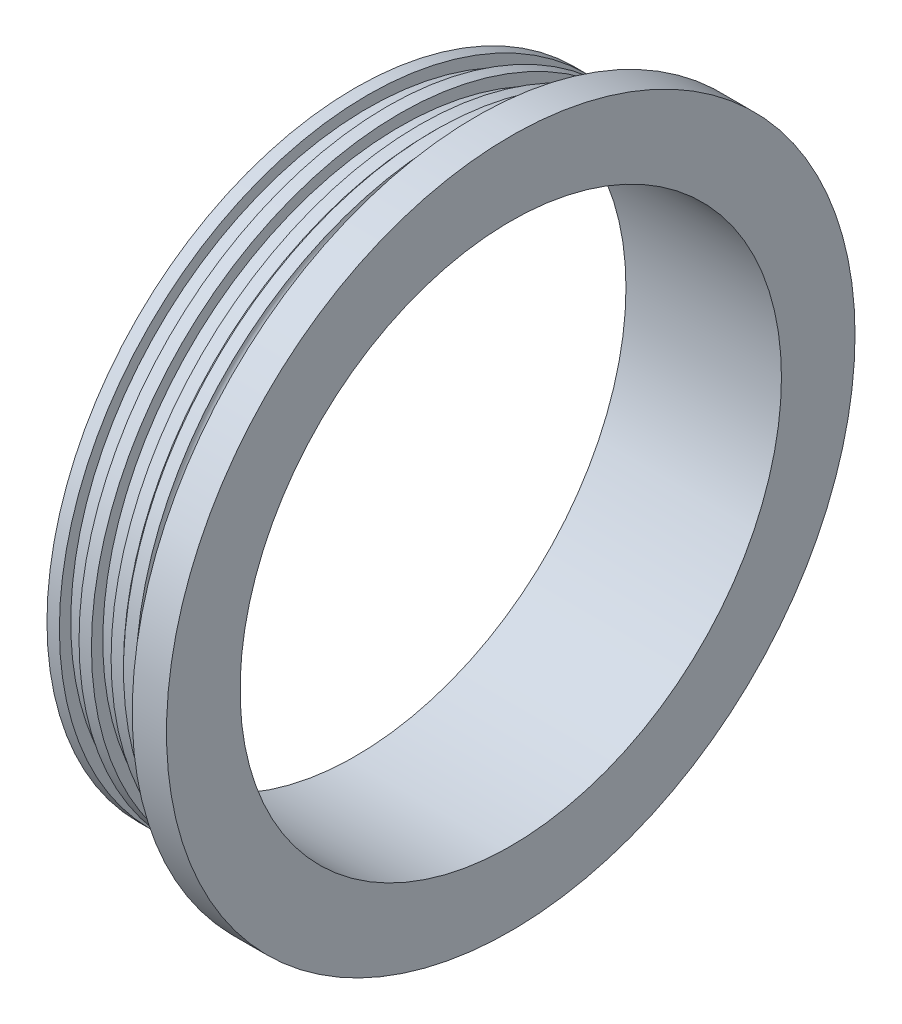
ISO-10303-21;
HEADER;
FILE_DESCRIPTION(('STEP AP214'),'2;1');
FILE_NAME('part.step','',(''),(''),'','','');
FILE_SCHEMA(('AUTOMOTIVE_DESIGN { 1 0 10303 214 1 1 1 1 }'));
ENDSEC;
DATA;
#1=APPLICATION_CONTEXT('core data for automotive mechanical design processes');
#2=APPLICATION_PROTOCOL_DEFINITION('international standard','automotive_design',2000,#1);
#3=PRODUCT_CONTEXT('',#1,'mechanical');
#4=PRODUCT('Part','Part','',(#3));
#5=PRODUCT_RELATED_PRODUCT_CATEGORY('part','',(#4));
#6=PRODUCT_DEFINITION_FORMATION('','',#4);
#7=PRODUCT_DEFINITION_CONTEXT('part definition',#1,'design');
#8=PRODUCT_DEFINITION('design','',#6,#7);
#9=PRODUCT_DEFINITION_SHAPE('','',#8);
#10=(LENGTH_UNIT() NAMED_UNIT(*) SI_UNIT(.MILLI.,.METRE.));
#11=(NAMED_UNIT(*) PLANE_ANGLE_UNIT() SI_UNIT($,.RADIAN.));
#12=(NAMED_UNIT(*) SI_UNIT($,.STERADIAN.) SOLID_ANGLE_UNIT());
#13=UNCERTAINTY_MEASURE_WITH_UNIT(LENGTH_MEASURE(1.E-05),#10,'distance_accuracy_value','');
#14=(GEOMETRIC_REPRESENTATION_CONTEXT(3) GLOBAL_UNCERTAINTY_ASSIGNED_CONTEXT((#13)) GLOBAL_UNIT_ASSIGNED_CONTEXT((#10,
#11,#12)) REPRESENTATION_CONTEXT('',''));
#15=CARTESIAN_POINT('',(0.,0.,0.));
#16=DIRECTION('',(0.,0.,1.));
#17=DIRECTION('',(1.,0.,0.));
#18=AXIS2_PLACEMENT_3D('',#15,#16,#17);
#19=CARTESIAN_POINT('',(0.,0.,0.));
#20=DIRECTION('',(1.,0.,0.));
#21=DIRECTION('',(0.,0.,-1.));
#22=AXIS2_PLACEMENT_3D('',#19,#20,#21);
#23=CYLINDRICAL_SURFACE('',#22,75.2602);
#24=CARTESIAN_POINT('',(-12.1412,0.,0.));
#25=DIRECTION('',(1.,0.,0.));
#26=DIRECTION('',(0.,0.,-1.));
#27=AXIS2_PLACEMENT_3D('',#24,#25,#26);
#28=CIRCLE('',#27,75.2602);
#29=CARTESIAN_POINT('',(-12.1412,0.,-75.2602));
#30=VERTEX_POINT('',#29);
#31=EDGE_CURVE('E101',#30,#30,#28,.T.);
#32=ORIENTED_EDGE('',*,*,#31,.F.);
#33=EDGE_LOOP('',(#32));
#34=FACE_BOUND('',#33,.T.);
#35=CARTESIAN_POINT('',(-15.1384,0.,0.));
#36=DIRECTION('',(1.,0.,0.));
#37=DIRECTION('',(0.,0.,-1.));
#38=AXIS2_PLACEMENT_3D('',#35,#36,#37);
#39=CIRCLE('',#38,75.2602);
#40=CARTESIAN_POINT('',(-15.1384,0.,-75.2602));
#41=VERTEX_POINT('',#40);
#42=EDGE_CURVE('E12',#41,#41,#39,.T.);
#43=ORIENTED_EDGE('',*,*,#42,.T.);
#44=EDGE_LOOP('',(#43));
#45=FACE_BOUND('',#44,.T.);
#46=ADVANCED_FACE('F49',(#34,#45),#23,.T.);
#47=CARTESIAN_POINT('',(-15.9004,0.,0.));
#48=DIRECTION('',(1.,0.,0.));
#49=DIRECTION('',(0.,0.,-1.));
#50=AXIS2_PLACEMENT_3D('',#47,#48,#49);
#51=CONICAL_SURFACE('',#50,74.4982,0.785398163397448);
#52=ORIENTED_EDGE('',*,*,#42,.F.);
#53=EDGE_LOOP('',(#52));
#54=FACE_BOUND('',#53,.T.);
#55=CARTESIAN_POINT('',(-15.9004,0.,0.));
#56=DIRECTION('',(1.,0.,0.));
#57=DIRECTION('',(0.,0.,-1.));
#58=AXIS2_PLACEMENT_3D('',#55,#56,#57);
#59=CIRCLE('',#58,74.4982);
#60=CARTESIAN_POINT('',(-15.9004,0.,-74.4982));
#61=VERTEX_POINT('',#60);
#62=EDGE_CURVE('E55',#61,#61,#59,.T.);
#63=ORIENTED_EDGE('',*,*,#62,.T.);
#64=EDGE_LOOP('',(#63));
#65=FACE_BOUND('',#64,.T.);
#66=ADVANCED_FACE('F126',(#54,#65),#51,.T.);
#67=CARTESIAN_POINT('',(0.,0.,0.));
#68=DIRECTION('',(1.,0.,0.));
#69=DIRECTION('',(0.,0.,-1.));
#70=AXIS2_PLACEMENT_3D('',#67,#68,#69);
#71=CYLINDRICAL_SURFACE('',#70,74.4982);
#72=ORIENTED_EDGE('',*,*,#62,.F.);
#73=EDGE_LOOP('',(#72));
#74=FACE_BOUND('',#73,.T.);
#75=CARTESIAN_POINT('',(-18.8976,0.,0.));
#76=DIRECTION('',(1.,0.,0.));
#77=DIRECTION('',(0.,0.,-1.));
#78=AXIS2_PLACEMENT_3D('',#75,#76,#77);
#79=CIRCLE('',#78,74.4982);
#80=CARTESIAN_POINT('',(-18.8976,0.,-74.4982));
#81=VERTEX_POINT('',#80);
#82=EDGE_CURVE('E59',#81,#81,#79,.T.);
#83=ORIENTED_EDGE('',*,*,#82,.T.);
#84=EDGE_LOOP('',(#83));
#85=FACE_BOUND('',#84,.T.);
#86=ADVANCED_FACE('F131',(#74,#85),#71,.T.);
#87=CARTESIAN_POINT('',(-18.8976,0.,0.));
#88=DIRECTION('',(-1.,0.,0.));
#89=DIRECTION('',(0.,0.,1.));
#90=AXIS2_PLACEMENT_3D('',#87,#88,#89);
#91=PLANE('',#90);
#92=CARTESIAN_POINT('',(-18.8976,0.,0.));
#93=DIRECTION('',(1.,0.,0.));
#94=DIRECTION('',(0.,0.,-1.));
#95=AXIS2_PLACEMENT_3D('',#92,#93,#94);
#96=CIRCLE('',#95,71.755);
#97=CARTESIAN_POINT('',(-18.8976,0.,-71.755));
#98=VERTEX_POINT('',#97);
#99=EDGE_CURVE('E63',#98,#98,#96,.T.);
#100=ORIENTED_EDGE('',*,*,#99,.T.);
#101=EDGE_LOOP('',(#100));
#102=FACE_BOUND('',#101,.T.);
#103=ORIENTED_EDGE('',*,*,#82,.F.);
#104=EDGE_LOOP('',(#103));
#105=FACE_BOUND('',#104,.T.);
#106=ADVANCED_FACE('F138',(#102,#105),#91,.T.);
#107=CARTESIAN_POINT('',(0.,0.,0.));
#108=DIRECTION('',(1.,0.,0.));
#109=DIRECTION('',(0.,0.,-1.));
#110=AXIS2_PLACEMENT_3D('',#107,#108,#109);
#111=CYLINDRICAL_SURFACE('',#110,71.755);
#112=ORIENTED_EDGE('',*,*,#99,.F.);
#113=EDGE_LOOP('',(#112));
#114=FACE_BOUND('',#113,.T.);
#115=CARTESIAN_POINT('',(-23.6474,0.,0.));
#116=DIRECTION('',(1.,0.,0.));
#117=DIRECTION('',(0.,0.,-1.));
#118=AXIS2_PLACEMENT_3D('',#115,#116,#117);
#119=CIRCLE('',#118,71.755);
#120=CARTESIAN_POINT('',(-23.6474,0.,-71.755));
#121=VERTEX_POINT('',#120);
#122=EDGE_CURVE('E68',#121,#121,#119,.T.);
#123=ORIENTED_EDGE('',*,*,#122,.T.);
#124=EDGE_LOOP('',(#123));
#125=FACE_BOUND('',#124,.T.);
#126=ADVANCED_FACE('F144',(#114,#125),#111,.T.);
#127=CARTESIAN_POINT('',(-23.6474,0.,0.));
#128=DIRECTION('',(-1.,0.,0.));
#129=DIRECTION('',(0.,0.,1.));
#130=AXIS2_PLACEMENT_3D('',#127,#128,#129);
#131=PLANE('',#130);
#132=ORIENTED_EDGE('',*,*,#122,.F.);
#133=EDGE_LOOP('',(#132));
#134=FACE_BOUND('',#133,.T.);
#135=CARTESIAN_POINT('',(-23.6474,0.,0.));
#136=DIRECTION('',(1.,0.,0.));
#137=DIRECTION('',(0.,0.,-1.));
#138=AXIS2_PLACEMENT_3D('',#135,#136,#137);
#139=CIRCLE('',#138,74.4982);
#140=CARTESIAN_POINT('',(-23.6474,0.,-74.4982));
#141=VERTEX_POINT('',#140);
#142=EDGE_CURVE('E71',#141,#141,#139,.T.);
#143=ORIENTED_EDGE('',*,*,#142,.T.);
#144=EDGE_LOOP('',(#143));
#145=FACE_BOUND('',#144,.T.);
#146=ADVANCED_FACE('F146',(#134,#145),#131,.F.);
#147=CARTESIAN_POINT('',(0.,0.,0.));
#148=DIRECTION('',(1.,0.,0.));
#149=DIRECTION('',(0.,0.,-1.));
#150=AXIS2_PLACEMENT_3D('',#147,#148,#149);
#151=CYLINDRICAL_SURFACE('',#150,74.4982);
#152=ORIENTED_EDGE('',*,*,#142,.F.);
#153=EDGE_LOOP('',(#152));
#154=FACE_BOUND('',#153,.T.);
#155=CARTESIAN_POINT('',(-26.6446,0.,0.));
#156=DIRECTION('',(1.,0.,0.));
#157=DIRECTION('',(0.,0.,-1.));
#158=AXIS2_PLACEMENT_3D('',#155,#156,#157);
#159=CIRCLE('',#158,74.4982);
#160=CARTESIAN_POINT('',(-26.6446,0.,-74.4982));
#161=VERTEX_POINT('',#160);
#162=EDGE_CURVE('E74',#161,#161,#159,.T.);
#163=ORIENTED_EDGE('',*,*,#162,.T.);
#164=EDGE_LOOP('',(#163));
#165=FACE_BOUND('',#164,.T.);
#166=ADVANCED_FACE('F149',(#154,#165),#151,.T.);
#167=CARTESIAN_POINT('',(-26.6446,0.,0.));
#168=DIRECTION('',(-1.,0.,0.));
#169=DIRECTION('',(0.,0.,1.));
#170=AXIS2_PLACEMENT_3D('',#167,#168,#169);
#171=PLANE('',#170);
#172=CARTESIAN_POINT('',(-26.6446,0.,0.));
#173=DIRECTION('',(1.,0.,0.));
#174=DIRECTION('',(0.,0.,-1.));
#175=AXIS2_PLACEMENT_3D('',#172,#173,#174);
#176=CIRCLE('',#175,71.755);
#177=CARTESIAN_POINT('',(-26.6446,0.,-71.755));
#178=VERTEX_POINT('',#177);
#179=EDGE_CURVE('E77',#178,#178,#176,.T.);
#180=ORIENTED_EDGE('',*,*,#179,.T.);
#181=EDGE_LOOP('',(#180));
#182=FACE_BOUND('',#181,.T.);
#183=ORIENTED_EDGE('',*,*,#162,.F.);
#184=EDGE_LOOP('',(#183));
#185=FACE_BOUND('',#184,.T.);
#186=ADVANCED_FACE('F153',(#182,#185),#171,.T.);
#187=ORIENTED_EDGE('',*,*,#179,.F.);
#188=EDGE_LOOP('',(#187));
#189=FACE_BOUND('',#188,.T.);
#190=CARTESIAN_POINT('',(-31.3944,0.,0.));
#191=DIRECTION('',(1.,0.,0.));
#192=DIRECTION('',(0.,0.,-1.));
#193=AXIS2_PLACEMENT_3D('',#190,#191,#192);
#194=CIRCLE('',#193,71.755);
#195=CARTESIAN_POINT('',(-31.3944,0.,-71.755));
#196=VERTEX_POINT('',#195);
#197=EDGE_CURVE('E80',#196,#196,#194,.T.);
#198=ORIENTED_EDGE('',*,*,#197,.T.);
#199=EDGE_LOOP('',(#198));
#200=FACE_BOUND('',#199,.T.);
#201=ADVANCED_FACE('F157',(#189,#200),#111,.T.);
#202=CARTESIAN_POINT('',(-31.3944,0.,0.));
#203=DIRECTION('',(-1.,0.,0.));
#204=DIRECTION('',(0.,0.,1.));
#205=AXIS2_PLACEMENT_3D('',#202,#203,#204);
#206=PLANE('',#205);
#207=ORIENTED_EDGE('',*,*,#197,.F.);
#208=EDGE_LOOP('',(#207));
#209=FACE_BOUND('',#208,.T.);
#210=CARTESIAN_POINT('',(-31.3944,0.,0.));
#211=DIRECTION('',(1.,0.,0.));
#212=DIRECTION('',(0.,0.,-1.));
#213=AXIS2_PLACEMENT_3D('',#210,#211,#212);
#214=CIRCLE('',#213,74.4982);
#215=CARTESIAN_POINT('',(-31.3944,0.,-74.4982));
#216=VERTEX_POINT('',#215);
#217=EDGE_CURVE('E83',#216,#216,#214,.T.);
#218=ORIENTED_EDGE('',*,*,#217,.T.);
#219=EDGE_LOOP('',(#218));
#220=FACE_BOUND('',#219,.T.);
#221=ADVANCED_FACE('F161',(#209,#220),#206,.F.);
#222=CARTESIAN_POINT('',(0.,0.,0.));
#223=DIRECTION('',(1.,0.,0.));
#224=DIRECTION('',(0.,0.,-1.));
#225=AXIS2_PLACEMENT_3D('',#222,#223,#224);
#226=CYLINDRICAL_SURFACE('',#225,74.4982);
#227=ORIENTED_EDGE('',*,*,#217,.F.);
#228=EDGE_LOOP('',(#227));
#229=FACE_BOUND('',#228,.T.);
#230=CARTESIAN_POINT('',(-34.3916,0.,0.));
#231=DIRECTION('',(1.,0.,0.));
#232=DIRECTION('',(0.,0.,-1.));
#233=AXIS2_PLACEMENT_3D('',#230,#231,#232);
#234=CIRCLE('',#233,74.4982);
#235=CARTESIAN_POINT('',(-34.3916,0.,-74.4982));
#236=VERTEX_POINT('',#235);
#237=EDGE_CURVE('E86',#236,#236,#234,.T.);
#238=ORIENTED_EDGE('',*,*,#237,.T.);
#239=EDGE_LOOP('',(#238));
#240=FACE_BOUND('',#239,.T.);
#241=ADVANCED_FACE('F165',(#229,#240),#226,.T.);
#242=CARTESIAN_POINT('',(-34.3916,0.,0.));
#243=DIRECTION('',(1.,0.,0.));
#244=DIRECTION('',(0.,0.,-1.));
#245=AXIS2_PLACEMENT_3D('',#242,#243,#244);
#246=PLANE('',#245);
#247=ORIENTED_EDGE('',*,*,#237,.F.);
#248=EDGE_LOOP('',(#247));
#249=FACE_BOUND('',#248,.T.);
#250=CARTESIAN_POINT('',(-34.3916,0.,0.));
#251=DIRECTION('',(1.,0.,0.));
#252=DIRECTION('',(0.,0.,-1.));
#253=AXIS2_PLACEMENT_3D('',#250,#251,#252);
#254=CIRCLE('',#253,65.405);
#255=CARTESIAN_POINT('',(-34.3916,0.,-65.405));
#256=VERTEX_POINT('',#255);
#257=EDGE_CURVE('E89',#256,#256,#254,.T.);
#258=ORIENTED_EDGE('',*,*,#257,.T.);
#259=EDGE_LOOP('',(#258));
#260=FACE_BOUND('',#259,.T.);
#261=ADVANCED_FACE('F169',(#249,#260),#246,.F.);
#262=CARTESIAN_POINT('',(0.,0.,0.));
#263=DIRECTION('',(1.,0.,0.));
#264=DIRECTION('',(0.,0.,-1.));
#265=AXIS2_PLACEMENT_3D('',#262,#263,#264);
#266=CYLINDRICAL_SURFACE('',#265,65.405);
#267=ORIENTED_EDGE('',*,*,#257,.F.);
#268=EDGE_LOOP('',(#267));
#269=FACE_BOUND('',#268,.T.);
#270=CARTESIAN_POINT('',(3.175,0.,0.));
#271=DIRECTION('',(1.,0.,0.));
#272=DIRECTION('',(0.,0.,-1.));
#273=AXIS2_PLACEMENT_3D('',#270,#271,#272);
#274=CIRCLE('',#273,65.405);
#275=CARTESIAN_POINT('',(3.175,0.,-65.405));
#276=VERTEX_POINT('',#275);
#277=EDGE_CURVE('E107',#276,#276,#274,.T.);
#278=ORIENTED_EDGE('',*,*,#277,.T.);
#279=EDGE_LOOP('',(#278));
#280=FACE_BOUND('',#279,.T.);
#281=ADVANCED_FACE('F111',(#269,#280),#266,.F.);
#282=CARTESIAN_POINT('',(0.,0.,0.));
#283=DIRECTION('',(1.,0.,0.));
#284=DIRECTION('',(0.,0.,-1.));
#285=AXIS2_PLACEMENT_3D('',#282,#283,#284);
#286=CYLINDRICAL_SURFACE('',#285,83.185);
#287=CARTESIAN_POINT('',(-5.1054,0.,0.));
#288=DIRECTION('',(1.,0.,0.));
#289=DIRECTION('',(0.,0.,-1.));
#290=AXIS2_PLACEMENT_3D('',#287,#288,#289);
#291=CIRCLE('',#290,83.185);
#292=CARTESIAN_POINT('',(-5.1054,0.,-83.185));
#293=VERTEX_POINT('',#292);
#294=EDGE_CURVE('E92',#293,#293,#291,.T.);
#295=ORIENTED_EDGE('',*,*,#294,.T.);
#296=EDGE_LOOP('',(#295));
#297=FACE_BOUND('',#296,.T.);
#298=CARTESIAN_POINT('',(3.175,0.,0.));
#299=DIRECTION('',(1.,0.,0.));
#300=DIRECTION('',(0.,0.,-1.));
#301=AXIS2_PLACEMENT_3D('',#298,#299,#300);
#302=CIRCLE('',#301,83.185);
#303=CARTESIAN_POINT('',(3.175,0.,-83.185));
#304=VERTEX_POINT('',#303);
#305=EDGE_CURVE('E104',#304,#304,#302,.T.);
#306=ORIENTED_EDGE('',*,*,#305,.F.);
#307=EDGE_LOOP('',(#306));
#308=FACE_BOUND('',#307,.T.);
#309=ADVANCED_FACE('F176',(#297,#308),#286,.T.);
#310=CARTESIAN_POINT('',(-5.1054,0.,0.));
#311=DIRECTION('',(1.,0.,0.));
#312=DIRECTION('',(0.,0.,-1.));
#313=AXIS2_PLACEMENT_3D('',#310,#311,#312);
#314=PLANE('',#313);
#315=ORIENTED_EDGE('',*,*,#294,.F.);
#316=EDGE_LOOP('',(#315));
#317=FACE_BOUND('',#316,.T.);
#318=CARTESIAN_POINT('',(-5.1054,0.,0.));
#319=DIRECTION('',(1.,0.,0.));
#320=DIRECTION('',(0.,0.,-1.));
#321=AXIS2_PLACEMENT_3D('',#318,#319,#320);
#322=CIRCLE('',#321,75.2602);
#323=CARTESIAN_POINT('',(-5.1054,0.,-75.2602));
#324=VERTEX_POINT('',#323);
#325=EDGE_CURVE('E95',#324,#324,#322,.T.);
#326=ORIENTED_EDGE('',*,*,#325,.T.);
#327=EDGE_LOOP('',(#326));
#328=FACE_BOUND('',#327,.T.);
#329=ADVANCED_FACE('F179',(#317,#328),#314,.F.);
#330=CARTESIAN_POINT('',(0.,0.,0.));
#331=DIRECTION('',(1.,0.,0.));
#332=DIRECTION('',(0.,0.,-1.));
#333=AXIS2_PLACEMENT_3D('',#330,#331,#332);
#334=CYLINDRICAL_SURFACE('',#333,75.2602);
#335=ORIENTED_EDGE('',*,*,#325,.F.);
#336=EDGE_LOOP('',(#335));
#337=FACE_BOUND('',#336,.T.);
#338=CARTESIAN_POINT('',(-8.5598,0.,0.));
#339=DIRECTION('',(1.,0.,0.));
#340=DIRECTION('',(0.,0.,-1.));
#341=AXIS2_PLACEMENT_3D('',#338,#339,#340);
#342=CIRCLE('',#341,75.2602);
#343=CARTESIAN_POINT('',(-8.5598,0.,-75.2602));
#344=VERTEX_POINT('',#343);
#345=EDGE_CURVE('E98',#344,#344,#342,.T.);
#346=ORIENTED_EDGE('',*,*,#345,.T.);
#347=EDGE_LOOP('',(#346));
#348=FACE_BOUND('',#347,.T.);
#349=ADVANCED_FACE('F122',(#337,#348),#334,.T.);
#350=CARTESIAN_POINT('',(-10.3505,0.,0.));
#351=DIRECTION('',(1.,0.,0.));
#352=DIRECTION('',(0.,0.,-1.));
#353=AXIS2_PLACEMENT_3D('',#350,#351,#352);
#354=TOROIDAL_SURFACE('',#353,75.2602,1.7907);
#355=ORIENTED_EDGE('',*,*,#345,.F.);
#356=EDGE_LOOP('',(#355));
#357=FACE_BOUND('',#356,.T.);
#358=ORIENTED_EDGE('',*,*,#31,.T.);
#359=EDGE_LOOP('',(#358));
#360=FACE_BOUND('',#359,.T.);
#361=ADVANCED_FACE('F115',(#357,#360),#354,.F.);
#362=CARTESIAN_POINT('',(3.175,0.,0.));
#363=DIRECTION('',(1.,0.,0.));
#364=DIRECTION('',(0.,0.,-1.));
#365=AXIS2_PLACEMENT_3D('',#362,#363,#364);
#366=PLANE('',#365);
#367=ORIENTED_EDGE('',*,*,#305,.T.);
#368=EDGE_LOOP('',(#367));
#369=FACE_BOUND('',#368,.T.);
#370=ORIENTED_EDGE('',*,*,#277,.F.);
#371=EDGE_LOOP('',(#370));
#372=FACE_BOUND('',#371,.T.);
#373=ADVANCED_FACE('F113',(#369,#372),#366,.T.);
#374=CLOSED_SHELL('',(#46,#66,#86,#106,#126,#146,#166,#186,#201,#221,#241,#261,#281,#309,#329,
#349,#361,#373));
#375=MANIFOLD_SOLID_BREP('B2',#374);
#376=ADVANCED_BREP_SHAPE_REPRESENTATION('',(#18,#375),#14);
#377=SHAPE_DEFINITION_REPRESENTATION(#9,#376);
ENDSEC;
END-ISO-10303-21;
